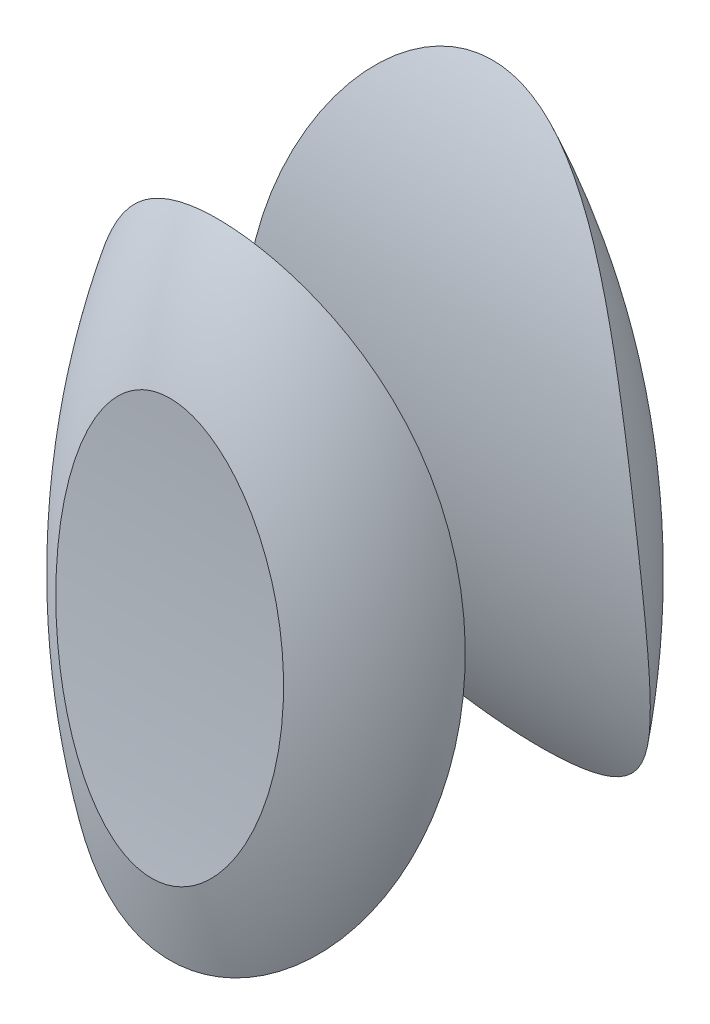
ISO-10303-21;
HEADER;
FILE_DESCRIPTION(('STEP AP214'),'2;1');
FILE_NAME('part.step','',(''),(''),'','','');
FILE_SCHEMA(('AUTOMOTIVE_DESIGN { 1 0 10303 214 1 1 1 1 }'));
ENDSEC;
DATA;
#1=APPLICATION_CONTEXT('core data for automotive mechanical design processes');
#2=APPLICATION_PROTOCOL_DEFINITION('international standard','automotive_design',2000,#1);
#3=PRODUCT_CONTEXT('',#1,'mechanical');
#4=PRODUCT('Part','Part','',(#3));
#5=PRODUCT_RELATED_PRODUCT_CATEGORY('part','',(#4));
#6=PRODUCT_DEFINITION_FORMATION('','',#4);
#7=PRODUCT_DEFINITION_CONTEXT('part definition',#1,'design');
#8=PRODUCT_DEFINITION('design','',#6,#7);
#9=PRODUCT_DEFINITION_SHAPE('','',#8);
#10=(LENGTH_UNIT() NAMED_UNIT(*) SI_UNIT(.MILLI.,.METRE.));
#11=(NAMED_UNIT(*) PLANE_ANGLE_UNIT() SI_UNIT($,.RADIAN.));
#12=(NAMED_UNIT(*) SI_UNIT($,.STERADIAN.) SOLID_ANGLE_UNIT());
#13=UNCERTAINTY_MEASURE_WITH_UNIT(LENGTH_MEASURE(1.E-05),#10,'distance_accuracy_value','');
#14=(GEOMETRIC_REPRESENTATION_CONTEXT(3) GLOBAL_UNCERTAINTY_ASSIGNED_CONTEXT((#13)) GLOBAL_UNIT_ASSIGNED_CONTEXT((#10,
#11,#12)) REPRESENTATION_CONTEXT('',''));
#15=CARTESIAN_POINT('',(0.,0.,0.));
#16=DIRECTION('',(0.,0.,1.));
#17=DIRECTION('',(1.,0.,0.));
#18=AXIS2_PLACEMENT_3D('',#15,#16,#17);
#19=CARTESIAN_POINT('',(-19.0366667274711,51.0993200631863,-67.4577213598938));
#20=DIRECTION('',(1.,0.,0.));
#21=DIRECTION('',(0.,0.,-1.));
#22=AXIS2_PLACEMENT_3D('',#19,#20,#21);
#23=CYLINDRICAL_SURFACE('',#22,60.);
#24=CARTESIAN_POINT('',(-11.6934335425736,25.8126324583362,-13.046477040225));
#25=CARTESIAN_POINT('',(-11.40823626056,25.4621805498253,-13.209343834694));
#26=CARTESIAN_POINT('',(-11.1099455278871,25.1220307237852,-13.3715493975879));
#27=CARTESIAN_POINT('',(-10.48652405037,24.4651300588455,-13.69199375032));
#28=CARTESIAN_POINT('',(-10.1613915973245,24.1483807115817,-13.8502322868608));
#29=CARTESIAN_POINT('',(-9.48428016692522,23.5416527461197,-14.159589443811));
#30=CARTESIAN_POINT('',(-9.13232069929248,23.2516550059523,-14.3107131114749));
#31=CARTESIAN_POINT('',(-8.4016611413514,22.7016438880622,-14.6025523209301));
#32=CARTESIAN_POINT('',(-8.0229674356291,22.4416233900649,-14.7432703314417));
#33=CARTESIAN_POINT('',(-7.31750731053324,22.0034181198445,-14.9841272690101));
#34=CARTESIAN_POINT('',(-6.99532243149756,21.8192273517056,-15.086781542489));
#35=CARTESIAN_POINT('',(-6.33542382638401,21.4744021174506,-15.2810657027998));
#36=CARTESIAN_POINT('',(-5.99771341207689,21.3137626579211,-15.3726979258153));
#37=CARTESIAN_POINT('',(-5.30826472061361,21.0179787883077,-15.5429638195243));
#38=CARTESIAN_POINT('',(-4.95653180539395,20.8828247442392,-15.6216024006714));
#39=CARTESIAN_POINT('',(-4.24082486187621,20.6397346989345,-15.7640705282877));
#40=CARTESIAN_POINT('',(-3.87685068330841,20.5317990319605,-15.8278998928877));
#41=CARTESIAN_POINT('',(-3.13673376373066,20.3441391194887,-15.9394637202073));
#42=CARTESIAN_POINT('',(-2.76052834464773,20.2645986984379,-15.9870932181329));
#43=CARTESIAN_POINT('',(-2.00109992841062,20.1359708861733,-16.0643690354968));
#44=CARTESIAN_POINT('',(-1.61787688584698,20.0868836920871,-16.0940152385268));
#45=CARTESIAN_POINT('',(-0.847827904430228,20.0200046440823,-16.1344547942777));
#46=CARTESIAN_POINT('',(-0.46100307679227,20.0022034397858,-16.1452537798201));
#47=CARTESIAN_POINT('',(0.312852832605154,19.9981817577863,-16.1476909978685));
#48=CARTESIAN_POINT('',(0.699883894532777,20.0119586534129,-16.139330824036));
#49=CARTESIAN_POINT('',(1.4310741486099,20.0678138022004,-16.105540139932));
#50=CARTESIAN_POINT('',(1.77555739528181,20.1068429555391,-16.081949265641));
#51=CARTESIAN_POINT('',(2.45945723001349,20.2095813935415,-16.0201121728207));
#52=CARTESIAN_POINT('',(2.79887423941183,20.2732886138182,-15.9818671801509));
#53=CARTESIAN_POINT('',(3.47045165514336,20.4245448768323,-15.8915900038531));
#54=CARTESIAN_POINT('',(3.80261224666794,20.5120933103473,-15.8395581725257));
#55=CARTESIAN_POINT('',(4.45779143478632,20.7099548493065,-15.7228234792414));
#56=CARTESIAN_POINT('',(4.78080956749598,20.820269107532,-15.658119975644));
#57=CARTESIAN_POINT('',(5.42525175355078,21.0658915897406,-15.5153117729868));
#58=CARTESIAN_POINT('',(5.74636213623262,21.2018279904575,-15.4368748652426));
#59=CARTESIAN_POINT('',(6.37584075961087,21.4949671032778,-15.2694970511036));
#60=CARTESIAN_POINT('',(6.68420915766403,21.6521695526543,-15.1805562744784));
#61=CARTESIAN_POINT('',(7.28730803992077,21.9863507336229,-14.9937180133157));
#62=CARTESIAN_POINT('',(7.58203449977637,22.1633352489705,-14.8958179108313));
#63=CARTESIAN_POINT('',(8.15712080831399,22.5355171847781,-14.692636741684));
#64=CARTESIAN_POINT('',(8.43747763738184,22.73071840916,-14.5873541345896));
#65=CARTESIAN_POINT('',(9.11420435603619,23.2353839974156,-14.3190617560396));
#66=CARTESIAN_POINT('',(9.50181756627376,23.5547924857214,-14.1525572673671));
#67=CARTESIAN_POINT('',(10.2443089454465,24.225629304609,-13.8112257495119));
#68=CARTESIAN_POINT('',(10.5991749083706,24.5770694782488,-13.6363956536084));
#69=CARTESIAN_POINT('',(11.2771108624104,25.3084384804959,-13.2821202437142));
#70=CARTESIAN_POINT('',(11.6001237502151,25.6884163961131,-13.1026673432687));
#71=CARTESIAN_POINT('',(12.2145446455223,26.4726063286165,-12.7429039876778));
#72=CARTESIAN_POINT('',(12.5059520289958,26.8768188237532,-12.5625935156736));
#73=CARTESIAN_POINT('',(13.1610613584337,27.8604122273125,-12.1374125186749));
#74=CARTESIAN_POINT('',(13.5114185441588,28.4490954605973,-11.8934354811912));
#75=CARTESIAN_POINT('',(14.1586310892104,29.6590231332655,-11.415439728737));
#76=CARTESIAN_POINT('',(14.4554677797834,30.2802788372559,-11.1814245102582));
#77=CARTESIAN_POINT('',(14.9994543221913,31.5499888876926,-10.7278479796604));
#78=CARTESIAN_POINT('',(15.2465532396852,32.1984703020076,-10.5083016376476));
#79=CARTESIAN_POINT('',(15.6940790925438,33.5169771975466,-10.0875161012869));
#80=CARTESIAN_POINT('',(15.8945057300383,34.1870028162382,-9.88627702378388));
#81=CARTESIAN_POINT('',(16.3060689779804,35.7505567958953,-9.44686541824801));
#82=CARTESIAN_POINT('',(16.5019821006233,36.6501804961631,-9.21602955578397));
#83=CARTESIAN_POINT('',(16.8256248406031,38.470858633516,-8.79430837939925));
#84=CARTESIAN_POINT('',(16.9533349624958,39.3919191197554,-8.60343449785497));
#85=CARTESIAN_POINT('',(17.1452067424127,41.2487126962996,-8.26433870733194));
#86=CARTESIAN_POINT('',(17.2093429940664,42.1844515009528,-8.116133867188));
#87=CARTESIAN_POINT('',(17.2774930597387,44.0639061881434,-7.86408072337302));
#88=CARTESIAN_POINT('',(17.281511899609,45.0076213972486,-7.76022871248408));
#89=CARTESIAN_POINT('',(17.2315524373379,46.9092385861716,-7.59650400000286));
#90=CARTESIAN_POINT('',(17.1768458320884,47.8671700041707,-7.53719944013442));
#91=CARTESIAN_POINT('',(17.0096685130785,49.7797734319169,-7.4645991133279));
#92=CARTESIAN_POINT('',(16.8971939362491,50.7344452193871,-7.45130642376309));
#93=CARTESIAN_POINT('',(16.6146541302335,52.6350855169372,-7.46984886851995));
#94=CARTESIAN_POINT('',(16.4445716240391,53.5810513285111,-7.50169755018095));
#95=CARTESIAN_POINT('',(16.0458264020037,55.4579544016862,-7.60886464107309));
#96=CARTESIAN_POINT('',(15.8171718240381,56.3888937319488,-7.68417701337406));
#97=CARTESIAN_POINT('',(15.3293880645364,58.1208741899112,-7.86440231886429));
#98=CARTESIAN_POINT('',(15.0770330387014,58.9242868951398,-7.9647768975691));
#99=CARTESIAN_POINT('',(14.6608346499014,60.1129977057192,-8.13728413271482));
#100=CARTESIAN_POINT('',(14.5157951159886,60.506568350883,-8.19845691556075));
#101=CARTESIAN_POINT('',(14.2126905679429,61.2874970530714,-8.32771556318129));
#102=CARTESIAN_POINT('',(14.0546266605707,61.6748556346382,-8.39580084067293));
#103=CARTESIAN_POINT('',(13.725206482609,62.4419457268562,-8.53831196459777));
#104=CARTESIAN_POINT('',(13.5538717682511,62.8216883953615,-8.61272754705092));
#105=CARTESIAN_POINT('',(13.1970817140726,63.5732535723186,-8.7674482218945));
#106=CARTESIAN_POINT('',(13.0116268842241,63.9450763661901,-8.84775310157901));
#107=CARTESIAN_POINT('',(12.6259986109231,64.6795538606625,-9.01356945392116));
#108=CARTESIAN_POINT('',(12.4258337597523,65.0422137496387,-9.0990778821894));
#109=CARTESIAN_POINT('',(12.0098670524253,65.757416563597,-9.27459824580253));
#110=CARTESIAN_POINT('',(11.7940630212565,66.1099580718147,-9.36461080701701));
#111=CARTESIAN_POINT('',(11.3115014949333,66.8567604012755,-9.56234813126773));
#112=CARTESIAN_POINT('',(11.0420101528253,67.2491068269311,-9.67066908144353));
#113=CARTESIAN_POINT('',(10.4796153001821,68.0156360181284,-9.89039421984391));
#114=CARTESIAN_POINT('',(10.1867182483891,68.3898237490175,-10.0017975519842));
#115=CARTESIAN_POINT('',(9.57602526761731,69.1166522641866,-10.2255606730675));
#116=CARTESIAN_POINT('',(9.25824564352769,69.4693068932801,-10.3379197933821));
#117=CARTESIAN_POINT('',(8.59604584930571,70.1492235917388,-10.561068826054));
#118=CARTESIAN_POINT('',(8.25163249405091,70.4764921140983,-10.6718591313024));
#119=CARTESIAN_POINT('',(7.62279169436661,71.0239744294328,-10.8620465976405));
#120=CARTESIAN_POINT('',(7.3443868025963,71.2507499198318,-10.9424752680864));
#121=CARTESIAN_POINT('',(6.77121792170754,71.6843734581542,-11.0989716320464));
#122=CARTESIAN_POINT('',(6.47645417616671,71.8912218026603,-11.1750393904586));
#123=CARTESIAN_POINT('',(5.8709310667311,72.2817272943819,-11.3208437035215));
#124=CARTESIAN_POINT('',(5.56019224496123,72.4654132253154,-11.3905880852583));
#125=CARTESIAN_POINT('',(4.92291806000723,72.8065158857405,-11.5217663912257));
#126=CARTESIAN_POINT('',(4.59638692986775,72.963939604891,-11.5832025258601));
#127=CARTESIAN_POINT('',(4.00127279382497,73.2180437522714,-11.6833861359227));
#128=CARTESIAN_POINT('',(3.73548947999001,73.3204926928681,-11.7241641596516));
#129=CARTESIAN_POINT('',(3.19607185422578,73.5054231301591,-11.7982524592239));
#130=CARTESIAN_POINT('',(2.92243941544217,73.5879093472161,-11.831564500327));
#131=CARTESIAN_POINT('',(2.36887100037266,73.7313322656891,-11.8897627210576));
#132=CARTESIAN_POINT('',(2.08893926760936,73.7922830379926,-11.9146544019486));
#133=CARTESIAN_POINT('',(1.52439186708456,73.8914321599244,-11.9552663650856));
#134=CARTESIAN_POINT('',(1.23977616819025,73.9296303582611,-11.9709865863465));
#135=CARTESIAN_POINT('',(0.666767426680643,73.9825177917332,-11.9927766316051));
#136=CARTESIAN_POINT('',(0.378363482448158,73.9971066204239,-11.9988052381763));
#137=CARTESIAN_POINT('',(-0.198691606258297,74.0021138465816,-12.000872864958));
#138=CARTESIAN_POINT('',(-0.487342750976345,73.9925322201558,-11.9969118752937));
#139=CARTESIAN_POINT('',(-1.06261191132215,73.9494228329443,-11.9791368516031));
#140=CARTESIAN_POINT('',(-1.34922935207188,73.9158885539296,-11.965320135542));
#141=CARTESIAN_POINT('',(-1.91815618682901,73.8256420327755,-11.9282998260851));
#142=CARTESIAN_POINT('',(-2.20046558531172,73.7689298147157,-11.9050962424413));
#143=CARTESIAN_POINT('',(-2.74333110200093,73.6373244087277,-11.8515787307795));
#144=CARTESIAN_POINT('',(-3.00422364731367,73.563618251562,-11.8217322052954));
#145=CARTESIAN_POINT('',(-3.51918423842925,73.3979225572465,-11.7551155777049));
#146=CARTESIAN_POINT('',(-3.77325273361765,73.3059342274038,-11.7183459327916));
#147=CARTESIAN_POINT('',(-4.27366035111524,73.1050754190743,-11.6387426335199));
#148=CARTESIAN_POINT('',(-4.5199984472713,72.9962027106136,-11.5959081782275));
#149=CARTESIAN_POINT('',(-5.00430119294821,72.7630300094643,-11.5050686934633));
#150=CARTESIAN_POINT('',(-5.24226377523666,72.6387262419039,-11.4570623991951));
#151=CARTESIAN_POINT('',(-5.84605095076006,72.2992955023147,-11.3274214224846));
#152=CARTESIAN_POINT('',(-6.20525718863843,72.0735698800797,-11.2425402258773));
#153=CARTESIAN_POINT('',(-6.90108127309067,71.5922044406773,-11.0652793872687));
#154=CARTESIAN_POINT('',(-7.23768780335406,71.3365498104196,-10.972896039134));
#155=CARTESIAN_POINT('',(-7.88935177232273,70.7993052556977,-10.7832834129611));
#156=CARTESIAN_POINT('',(-8.20435643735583,70.5176555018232,-10.6860432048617));
#157=CARTESIAN_POINT('',(-8.81279025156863,69.9327825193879,-10.489345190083));
#158=CARTESIAN_POINT('',(-9.10621995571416,69.6295598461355,-10.3898874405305));
#159=CARTESIAN_POINT('',(-9.61334532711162,69.0700706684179,-10.2115912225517));
#160=CARTESIAN_POINT('',(-9.83088119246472,68.817248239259,-10.1327911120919));
#161=CARTESIAN_POINT('',(-10.2537342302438,68.3013592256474,-9.97587532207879));
#162=CARTESIAN_POINT('',(-10.4590499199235,68.0382914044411,-9.89775972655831));
#163=CARTESIAN_POINT('',(-11.0576506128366,67.2352485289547,-9.6654915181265));
#164=CARTESIAN_POINT('',(-11.433482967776,66.6815530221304,-9.51345575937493));
#165=CARTESIAN_POINT('',(-12.1430377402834,65.5443859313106,-9.21953851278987));
#166=CARTESIAN_POINT('',(-12.4766980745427,64.9608721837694,-9.0776721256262));
#167=CARTESIAN_POINT('',(-13.1049133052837,63.770183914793,-8.80772785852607));
#168=CARTESIAN_POINT('',(-13.3994709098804,63.1630110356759,-8.67964902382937));
#169=CARTESIAN_POINT('',(-13.8748599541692,62.1022742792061,-8.47348786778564));
#170=CARTESIAN_POINT('',(-14.0644291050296,61.6533469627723,-8.39145312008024));
#171=CARTESIAN_POINT('',(-14.4257092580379,60.746746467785,-8.23662220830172));
#172=CARTESIAN_POINT('',(-14.5974188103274,60.2890725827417,-8.16382679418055));
#173=CARTESIAN_POINT('',(-14.9237349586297,59.3660929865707,-8.02811479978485));
#174=CARTESIAN_POINT('',(-15.0783367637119,58.9007851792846,-7.96520098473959));
#175=CARTESIAN_POINT('',(-15.3709963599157,57.9636727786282,-7.84980602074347));
#176=CARTESIAN_POINT('',(-15.509052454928,57.491867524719,-7.79732594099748));
#177=CARTESIAN_POINT('',(-15.7691148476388,56.5426356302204,-7.70324188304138));
#178=CARTESIAN_POINT('',(-15.891116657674,56.0652074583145,-7.66164094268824));
#179=CARTESIAN_POINT('',(-16.1193852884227,55.1057499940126,-7.58969888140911));
#180=CARTESIAN_POINT('',(-16.2256506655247,54.6237202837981,-7.55935879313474));
#181=CARTESIAN_POINT('',(-16.5211980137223,53.1722353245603,-7.48572200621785));
#182=CARTESIAN_POINT('',(-16.6873294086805,52.1970228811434,-7.45977259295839));
#183=CARTESIAN_POINT('',(-16.9607592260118,50.2231257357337,-7.4558735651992));
#184=CARTESIAN_POINT('',(-17.0671142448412,49.224310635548,-7.47866775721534));
#185=CARTESIAN_POINT('',(-17.216544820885,47.2242098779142,-7.57462028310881));
#186=CARTESIAN_POINT('',(-17.2596142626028,46.2229239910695,-7.64778348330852));
#187=CARTESIAN_POINT('',(-17.2805681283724,44.2247530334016,-7.84439991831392));
#188=CARTESIAN_POINT('',(-17.2584633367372,43.227867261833,-7.96784483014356));
#189=CARTESIAN_POINT('',(-17.145861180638,41.2454024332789,-8.26393750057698));
#190=CARTESIAN_POINT('',(-17.055379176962,40.2598208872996,-8.43657420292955));
#191=CARTESIAN_POINT('',(-16.8246174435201,38.4859072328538,-8.79287212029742));
#192=CARTESIAN_POINT('',(-16.6964488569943,37.6944216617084,-8.96876303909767));
#193=CARTESIAN_POINT('',(-16.3880590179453,36.1286570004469,-9.34982075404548));
#194=CARTESIAN_POINT('',(-16.2078353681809,35.3543787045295,-9.55498889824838));
#195=CARTESIAN_POINT('',(-15.7919398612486,33.8302947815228,-9.99114243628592));
#196=CARTESIAN_POINT('',(-15.5563961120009,33.080437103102,-10.2220675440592));
#197=CARTESIAN_POINT('',(-15.0251964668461,31.6098136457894,-10.7060042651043));
#198=CARTESIAN_POINT('',(-14.7295695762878,30.8890340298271,-10.959005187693));
#199=CARTESIAN_POINT('',(-14.2186135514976,29.795159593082,-11.3657634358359));
#200=CARTESIAN_POINT('',(-14.0256655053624,29.4093910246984,-11.5138781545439));
#201=CARTESIAN_POINT('',(-13.6186730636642,28.6507306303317,-11.8139703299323));
#202=CARTESIAN_POINT('',(-13.4046324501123,28.2778365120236,-11.9659470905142));
#203=CARTESIAN_POINT('',(-12.9544763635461,27.5464590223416,-12.2723969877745));
#204=CARTESIAN_POINT('',(-12.7183534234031,27.1879805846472,-12.4268709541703));
#205=CARTESIAN_POINT('',(-12.2232341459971,26.4874487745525,-12.7365876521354));
#206=CARTESIAN_POINT('',(-11.9642363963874,26.1453964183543,-12.8918304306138));
#207=CARTESIAN_POINT('',(-11.6934335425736,25.8126324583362,-13.046477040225));
#208=B_SPLINE_CURVE_WITH_KNOTS('',3,(#24,#25,#26,#27,#28,#29,#30,#31,#32,#33,#34,#35,#36,#37,
#38,#39,#40,#41,#42,#43,#44,#45,#46,#47,#48,#49,#50,#51,#52,#53,#54,#55,#56,#57,#58,#59,#60,#61,
#62,#63,#64,#65,#66,#67,#68,#69,#70,#71,#72,#73,#74,#75,#76,#77,#78,#79,#80,#81,#82,#83,#84,#85,
#86,#87,#88,#89,#90,#91,#92,#93,#94,#95,#96,#97,#98,#99,#100,#101,#102,#103,#104,#105,#106,#107,
#108,#109,#110,#111,#112,#113,#114,#115,#116,#117,#118,#119,#120,#121,#122,#123,#124,#125,#126,
#127,#128,#129,#130,#131,#132,#133,#134,#135,#136,#137,#138,#139,#140,#141,#142,#143,#144,#145,
#146,#147,#148,#149,#150,#151,#152,#153,#154,#155,#156,#157,#158,#159,#160,#161,#162,#163,#164,
#165,#166,#167,#168,#169,#170,#171,#172,#173,#174,#175,#176,#177,#178,#179,#180,#181,#182,#183,
#184,#185,#186,#187,#188,#189,#190,#191,#192,#193,#194,#195,#196,#197,#198,#199,#200,#201,#202,
#203,#204,#205,#206,#207),.UNSPECIFIED.,.T.,.F.,(4,2,2,2,2,2,2,2,2,2,2,2,2,2,2,2,2,2,2,2,2,2,2,
2,2,2,2,2,2,2,2,2,2,2,2,2,2,2,2,2,2,2,2,2,2,2,2,2,2,2,2,2,2,2,2,2,2,2,2,2,2,2,2,2,2,2,2,2,2,2,2,
2,2,2,2,2,2,2,2,2,2,2,2,2,2,2,2,2,2,2,2,4),(0.,1.44059524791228,2.88128224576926,
4.32093133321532,5.76023776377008,6.91431452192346,8.06814623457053,9.22154089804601,
10.374949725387,11.5356955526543,12.6964488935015,13.8568552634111,15.0171651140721,
16.05841396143,17.0995757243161,18.1407108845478,19.181898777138,20.2530644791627,
21.3242169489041,22.3956834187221,23.4673741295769,25.0524158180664,26.638045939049,
28.2264688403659,29.8149230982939,31.9933162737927,34.172467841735,36.3538397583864,
38.5352255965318,41.3789021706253,44.2233911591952,47.0690164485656,49.9144038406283,
52.7954913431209,55.6767715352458,58.5589166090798,61.4406614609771,63.9825527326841,
65.2539498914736,66.5252391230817,67.7945049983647,69.0637250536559,70.3322095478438,
71.6008707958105,73.0644933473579,74.5277134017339,75.9899825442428,77.4518787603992,
78.5549971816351,79.6580991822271,80.7598165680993,81.8612402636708,82.7236759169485,
83.5859074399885,84.4475745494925,85.3092473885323,86.1745752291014,87.0399039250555,
87.9054681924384,88.7710315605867,89.5884395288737,90.4057935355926,91.223255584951,
92.0409180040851,93.3368091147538,94.6333443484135,95.9329418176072,97.2325058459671,
98.260251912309,99.2881224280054,101.344353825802,103.403577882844,105.462659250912,
106.944704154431,108.42686927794,109.909448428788,111.392179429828,112.87532402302,
114.358604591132,117.324040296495,120.335049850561,123.346350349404,126.357152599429,
129.367278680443,131.827713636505,134.288261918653,136.743167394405,139.196890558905,
140.564472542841,141.931809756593,143.299611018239,144.667496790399),.UNSPECIFIED.);
#209=CARTESIAN_POINT('',(-11.6934335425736,25.8126324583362,-13.046477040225));
#210=VERTEX_POINT('',#209);
#211=EDGE_CURVE('E43',#210,#210,#208,.T.);
#212=ORIENTED_EDGE('',*,*,#211,.T.);
#213=EDGE_LOOP('',(#212));
#214=FACE_BOUND('',#213,.T.);
#215=ADVANCED_FACE('F38',(#214),#23,.T.);
#216=CARTESIAN_POINT('',(0.,41.25,0.));
#217=DIRECTION('',(0.,1.,0.));
#218=DIRECTION('',(0.,0.,1.));
#219=AXIS2_PLACEMENT_3D('',#216,#217,#218);
#220=DEGENERATE_TOROIDAL_SURFACE('',#219,60.8075269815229,79.834193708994,.F.);
#221=CARTESIAN_POINT('',(-7.72043957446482,33.5090740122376,-16.9775024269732));
#222=CARTESIAN_POINT('',(-7.47341911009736,32.970534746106,-17.0322042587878));
#223=CARTESIAN_POINT('',(-7.20158457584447,32.4432461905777,-17.0879841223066));
#224=CARTESIAN_POINT('',(-6.75160292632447,31.6765659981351,-17.1719991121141));
#225=CARTESIAN_POINT('',(-6.5943805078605,31.4247926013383,-17.2000917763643));
#226=CARTESIAN_POINT('',(-6.26490240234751,30.93129914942,-17.2560688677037));
#227=CARTESIAN_POINT('',(-6.09265069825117,30.689576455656,-17.2839533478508));
#228=CARTESIAN_POINT('',(-5.72980185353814,30.215421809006,-17.3394878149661));
#229=CARTESIAN_POINT('',(-5.53900700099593,29.983138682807,-17.3671308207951));
#230=CARTESIAN_POINT('',(-5.13991651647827,29.53408335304,-17.4213179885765));
#231=CARTESIAN_POINT('',(-4.93161678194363,29.3173148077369,-17.4478618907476));
#232=CARTESIAN_POINT('',(-4.27998718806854,28.6969564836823,-17.5247874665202));
#233=CARTESIAN_POINT('',(-3.80820482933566,28.3209679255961,-17.5727410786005));
#234=CARTESIAN_POINT('',(-3.00166198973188,27.8188960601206,-17.6378285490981));
#235=CARTESIAN_POINT('',(-2.69152999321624,27.6539155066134,-17.659485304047));
#236=CARTESIAN_POINT('',(-2.20966296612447,27.4443886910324,-17.6871780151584));
#237=CARTESIAN_POINT('',(-2.04625264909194,27.3808678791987,-17.6956105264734));
#238=CARTESIAN_POINT('',(-1.71464217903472,27.2677184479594,-17.7106750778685));
#239=CARTESIAN_POINT('',(-1.54644399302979,27.2180842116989,-17.7173078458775));
#240=CARTESIAN_POINT('',(-1.2047572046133,27.133453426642,-17.7286400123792));
#241=CARTESIAN_POINT('',(-1.03123519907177,27.0985886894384,-17.7333219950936));
#242=CARTESIAN_POINT('',(-0.681738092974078,27.0450335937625,-17.7405217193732));
#243=CARTESIAN_POINT('',(-0.50576417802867,27.0263356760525,-17.7430404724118));
#244=CARTESIAN_POINT('',(-0.152816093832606,27.0056099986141,-17.7458326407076));
#245=CARTESIAN_POINT('',(0.0241580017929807,27.0035810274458,-17.7461062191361));
#246=CARTESIAN_POINT('',(0.377443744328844,27.0162178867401,-17.7444035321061));
#247=CARTESIAN_POINT('',(0.553755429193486,27.0308827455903,-17.7424273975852));
#248=CARTESIAN_POINT('',(1.04313162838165,27.0947062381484,-17.7338403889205));
#249=CARTESIAN_POINT('',(1.35395023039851,27.1619820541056,-17.7247987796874));
#250=CARTESIAN_POINT('',(1.96090495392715,27.3437137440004,-17.7005374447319));
#251=CARTESIAN_POINT('',(2.25703347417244,27.4581937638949,-17.6853145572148));
#252=CARTESIAN_POINT('',(2.94419814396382,27.780287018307,-17.6428756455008));
#253=CARTESIAN_POINT('',(3.32619381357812,28.0068317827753,-17.6132976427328));
#254=CARTESIAN_POINT('',(4.04900634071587,28.517465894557,-17.547768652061));
#255=CARTESIAN_POINT('',(4.38972491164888,28.8016884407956,-17.5118029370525));
#256=CARTESIAN_POINT('',(4.95900221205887,29.3431863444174,-17.4446518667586));
#257=CARTESIAN_POINT('',(5.19560354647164,29.5922732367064,-17.4141962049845));
#258=CARTESIAN_POINT('',(5.64616346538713,30.1101405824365,-17.3519488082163));
#259=CARTESIAN_POINT('',(5.86010924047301,30.378932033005,-17.3201563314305));
#260=CARTESIAN_POINT('',(6.26713120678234,30.9322870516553,-17.2559149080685));
#261=CARTESIAN_POINT('',(6.46017707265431,31.2168726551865,-17.2234650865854));
#262=CARTESIAN_POINT('',(6.82669738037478,31.7984169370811,-17.1584768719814));
#263=CARTESIAN_POINT('',(7.00016499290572,32.0953798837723,-17.1259384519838));
#264=CARTESIAN_POINT('',(7.44107468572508,32.9051526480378,-17.0391160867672));
#265=CARTESIAN_POINT('',(7.69193525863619,33.427061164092,-16.9851342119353));
#266=CARTESIAN_POINT('',(8.14797277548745,34.4907555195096,-16.8795185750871));
#267=CARTESIAN_POINT('',(8.35311994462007,35.0325540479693,-16.8278863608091));
#268=CARTESIAN_POINT('',(8.72216692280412,36.1311833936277,-16.7278402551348));
#269=CARTESIAN_POINT('',(8.88600116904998,36.6880365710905,-16.679431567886));
#270=CARTESIAN_POINT('',(9.17516695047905,37.8117796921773,-16.5865778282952));
#271=CARTESIAN_POINT('',(9.30050313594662,38.3786684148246,-16.5421322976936));
#272=CARTESIAN_POINT('',(9.56178984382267,39.7677503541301,-16.4392698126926));
#273=CARTESIAN_POINT('',(9.67864724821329,40.593746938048,-16.3831838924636));
#274=CARTESIAN_POINT('',(9.84266954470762,42.2534432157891,-16.2809501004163));
#275=CARTESIAN_POINT('',(9.88980068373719,43.0871464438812,-16.2348070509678));
#276=CARTESIAN_POINT('',(9.91655160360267,44.75670301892,-16.1529196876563));
#277=CARTESIAN_POINT('',(9.89612423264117,45.5925574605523,-16.1171826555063));
#278=CARTESIAN_POINT('',(9.78797037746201,47.2600402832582,-16.0563398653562));
#279=CARTESIAN_POINT('',(9.70027046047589,48.0916702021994,-16.0312299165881));
#280=CARTESIAN_POINT('',(9.48438798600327,49.5519067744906,-15.9961637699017));
#281=CARTESIAN_POINT('',(9.37043360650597,50.1825909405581,-15.9840384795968));
#282=CARTESIAN_POINT('',(9.1001610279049,51.4351121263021,-15.9658104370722));
#283=CARTESIAN_POINT('',(8.943836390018,52.0569477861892,-15.9597086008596));
#284=CARTESIAN_POINT('',(8.58658991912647,53.2857463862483,-15.9532748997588));
#285=CARTESIAN_POINT('',(8.38580317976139,53.8927483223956,-15.9529257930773));
#286=CARTESIAN_POINT('',(7.93528994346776,55.0881832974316,-15.9575394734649));
#287=CARTESIAN_POINT('',(7.68559684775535,55.67662869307,-15.9624986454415));
#288=CARTESIAN_POINT('',(7.27199811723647,56.5347898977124,-15.9733626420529));
#289=CARTESIAN_POINT('',(7.12890177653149,56.8146426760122,-15.9775089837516));
#290=CARTESIAN_POINT('',(6.82840753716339,57.3665165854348,-15.9868135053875));
#291=CARTESIAN_POINT('',(6.67101292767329,57.6385394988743,-15.9919714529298));
#292=CARTESIAN_POINT('',(6.3407270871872,58.1731984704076,-16.0031654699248));
#293=CARTESIAN_POINT('',(6.16782876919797,58.4358301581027,-16.0092019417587));
#294=CARTESIAN_POINT('',(5.80531986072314,58.9493044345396,-16.0219743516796));
#295=CARTESIAN_POINT('',(5.6157120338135,59.2001489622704,-16.0287101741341));
#296=CARTESIAN_POINT('',(5.25641414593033,59.6404211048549,-16.0413162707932));
#297=CARTESIAN_POINT('',(5.08986510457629,59.832409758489,-16.0471052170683));
#298=CARTESIAN_POINT('',(4.74409014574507,60.2047105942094,-16.0588371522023));
#299=CARTESIAN_POINT('',(4.56486294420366,60.3850215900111,-16.0647801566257));
#300=CARTESIAN_POINT('',(4.1933689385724,60.7310160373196,-16.0766181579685));
#301=CARTESIAN_POINT('',(4.00112916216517,60.8967282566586,-16.082513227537));
#302=CARTESIAN_POINT('',(3.60288008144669,61.2106510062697,-16.094032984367));
#303=CARTESIAN_POINT('',(3.39687275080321,61.3588640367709,-16.0996577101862));
#304=CARTESIAN_POINT('',(2.90157693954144,61.6786243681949,-16.1121014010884));
#305=CARTESIAN_POINT('',(2.60693215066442,61.8421717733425,-16.1187167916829));
#306=CARTESIAN_POINT('',(2.14864838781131,62.0511823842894,-16.1273582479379));
#307=CARTESIAN_POINT('',(1.99316250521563,62.1148022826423,-16.1300251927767));
#308=CARTESIAN_POINT('',(1.67736585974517,62.2286245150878,-16.1348398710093));
#309=CARTESIAN_POINT('',(1.51705727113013,62.2788327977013,-16.136987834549));
#310=CARTESIAN_POINT('',(1.19085204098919,62.3650365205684,-16.140698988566));
#311=CARTESIAN_POINT('',(1.02491463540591,62.4008788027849,-16.1422558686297));
#312=CARTESIAN_POINT('',(0.690438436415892,62.456560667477,-16.1446829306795));
#313=CARTESIAN_POINT('',(0.521900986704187,62.4764082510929,-16.1455534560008));
#314=CARTESIAN_POINT('',(0.183710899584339,62.4995013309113,-16.1465668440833));
#315=CARTESIAN_POINT('',(0.0140585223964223,62.5027505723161,-16.1467098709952));
#316=CARTESIAN_POINT('',(-0.324690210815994,62.4925816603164,-16.146263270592));
#317=CARTESIAN_POINT('',(-0.493786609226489,62.4791648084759,-16.1456737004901));
#318=CARTESIAN_POINT('',(-0.954795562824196,62.4199594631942,-16.1430837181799));
#319=CARTESIAN_POINT('',(-1.24470320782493,62.3575345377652,-16.1403609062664));
#320=CARTESIAN_POINT('',(-1.81101077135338,62.188472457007,-16.1331246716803));
#321=CARTESIAN_POINT('',(-2.08740288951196,62.081810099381,-16.1286102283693));
#322=CARTESIAN_POINT('',(-2.73866169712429,61.7775072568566,-16.1160674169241));
#323=CARTESIAN_POINT('',(-3.10442151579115,61.5604705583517,-16.1073637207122));
#324=CARTESIAN_POINT('',(-3.79720300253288,61.0715061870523,-16.0887780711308));
#325=CARTESIAN_POINT('',(-4.12412424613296,60.7994409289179,-16.0788931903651));
#326=CARTESIAN_POINT('',(-4.68204093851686,60.2720294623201,-16.0609791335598));
#327=CARTESIAN_POINT('',(-4.91945722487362,60.0233379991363,-16.0529544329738));
#328=CARTESIAN_POINT('',(-5.37194606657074,59.506229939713,-16.037316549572));
#329=CARTESIAN_POINT('',(-5.58700428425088,59.2378008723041,-16.029703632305));
#330=CARTESIAN_POINT('',(-5.99683103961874,58.6853477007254,-16.0152173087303));
#331=CARTESIAN_POINT('',(-6.19156815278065,58.4013004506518,-16.0083450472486));
#332=CARTESIAN_POINT('',(-6.56221653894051,57.8210785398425,-15.9956004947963));
#333=CARTESIAN_POINT('',(-6.73812108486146,57.5248995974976,-15.9897285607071));
#334=CARTESIAN_POINT('',(-7.05217821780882,56.9595543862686,-15.9798204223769));
#335=CARTESIAN_POINT('',(-7.19231980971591,56.6914882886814,-15.9756477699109));
#336=CARTESIAN_POINT('',(-7.46006520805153,56.1491340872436,-15.9683222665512));
#337=CARTESIAN_POINT('',(-7.58766715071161,55.8748450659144,-15.9651695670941));
#338=CARTESIAN_POINT('',(-7.952905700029,55.0439309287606,-15.9573662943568));
#339=CARTESIAN_POINT('',(-8.17286824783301,54.4794545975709,-15.954374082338));
#340=CARTESIAN_POINT('',(-8.57045058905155,53.3349361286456,-15.9532944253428));
#341=CARTESIAN_POINT('',(-8.74799799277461,52.754869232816,-15.9552153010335));
#342=CARTESIAN_POINT('',(-9.06343237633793,51.5842717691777,-15.9642858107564));
#343=CARTESIAN_POINT('',(-9.20132553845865,50.9937428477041,-15.9714346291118));
#344=CARTESIAN_POINT('',(-9.48727739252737,49.5678429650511,-15.9951097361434));
#345=CARTESIAN_POINT('',(-9.6173989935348,48.7288844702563,-16.0142410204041));
#346=CARTESIAN_POINT('',(-9.80762439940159,47.0431312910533,-16.0634258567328));
#347=CARTESIAN_POINT('',(-9.8676950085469,46.1963330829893,-16.0934845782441));
#348=CARTESIAN_POINT('',(-9.91860138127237,44.5010453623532,-16.1644997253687));
#349=CARTESIAN_POINT('',(-9.90943143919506,43.6525557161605,-16.2054570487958));
#350=CARTESIAN_POINT('',(-9.82065984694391,41.9600990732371,-16.2979477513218));
#351=CARTESIAN_POINT('',(-9.74109170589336,41.1161301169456,-16.3494760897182));
#352=CARTESIAN_POINT('',(-9.54350868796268,39.6936744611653,-16.4452901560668));
#353=CARTESIAN_POINT('',(-9.44448447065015,39.1123335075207,-16.4870295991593));
#354=CARTESIAN_POINT('',(-9.20867597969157,37.9575600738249,-16.5749570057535));
#355=CARTESIAN_POINT('',(-9.07188868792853,37.3841282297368,-16.621145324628));
#356=CARTESIAN_POINT('',(-8.75840751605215,36.2505166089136,-16.7172966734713));
#357=CARTESIAN_POINT('',(-8.5818446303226,35.6902998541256,-16.7672469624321));
#358=CARTESIAN_POINT('',(-8.18508655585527,34.5860792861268,-16.8702815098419));
#359=CARTESIAN_POINT('',(-7.96491584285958,34.0420665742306,-16.9233639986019));
#360=CARTESIAN_POINT('',(-7.72043957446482,33.5090740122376,-16.9775024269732));
#361=B_SPLINE_CURVE_WITH_KNOTS('',3,(#221,#222,#223,#224,#225,#226,#227,#228,#229,#230,#231,
#232,#233,#234,#235,#236,#237,#238,#239,#240,#241,#242,#243,#244,#245,#246,#247,#248,#249,#250,
#251,#252,#253,#254,#255,#256,#257,#258,#259,#260,#261,#262,#263,#264,#265,#266,#267,#268,#269,
#270,#271,#272,#273,#274,#275,#276,#277,#278,#279,#280,#281,#282,#283,#284,#285,#286,#287,#288,
#289,#290,#291,#292,#293,#294,#295,#296,#297,#298,#299,#300,#301,#302,#303,#304,#305,#306,#307,
#308,#309,#310,#311,#312,#313,#314,#315,#316,#317,#318,#319,#320,#321,#322,#323,#324,#325,#326,
#327,#328,#329,#330,#331,#332,#333,#334,#335,#336,#337,#338,#339,#340,#341,#342,#343,#344,#345,
#346,#347,#348,#349,#350,#351,#352,#353,#354,#355,#356,#357,#358,#359,#360),.UNSPECIFIED.,.T.,
.F.,(4,2,2,2,2,2,2,2,2,2,2,2,2,2,2,2,2,2,2,2,2,2,2,2,2,2,2,2,2,2,2,2,2,2,2,2,2,2,2,2,2,2,2,2,2,
2,2,2,2,2,2,2,2,2,2,2,2,2,2,2,2,2,2,2,2,2,2,2,2,4),(0.,1.78422981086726,2.6782530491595,
3.57204007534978,4.4767019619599,5.38157646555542,7.182647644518,8.23458024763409,
8.7606065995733,9.28641987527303,9.81683170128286,10.3469953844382,10.8771205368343,
11.4072148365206,12.3569956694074,13.3072629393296,14.6350997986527,15.9660387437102,
16.999331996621,18.0332063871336,19.0685613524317,20.1042763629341,21.8462629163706,
23.5893807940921,25.3352477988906,27.0809038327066,29.5858069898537,32.0919223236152,
34.5997871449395,37.1066620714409,39.028369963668,40.9503700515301,42.8666085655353,
44.7815428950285,45.7242322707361,46.6667053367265,47.6096114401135,48.5523618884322,
49.3145411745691,50.0767977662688,50.8375170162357,51.5981274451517,52.6051901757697,
53.1087535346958,53.6120931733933,54.1206647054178,54.6289816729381,55.137183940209,
55.6453465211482,56.5307088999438,57.4165763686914,58.6855578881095,59.9577522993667,
60.9880858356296,62.0190760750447,63.0516377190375,64.0845669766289,64.9917672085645,
65.8991020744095,67.714438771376,69.5328519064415,71.3509813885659,73.895279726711,
76.440783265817,78.986496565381,81.5309987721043,83.3034535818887,85.076050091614,
86.8428920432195,88.60874511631),.UNSPECIFIED.);
#362=CARTESIAN_POINT('',(-7.72043957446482,33.5090740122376,-16.9775024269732));
#363=VERTEX_POINT('',#362);
#364=EDGE_CURVE('E11',#363,#363,#361,.T.);
#365=ORIENTED_EDGE('',*,*,#364,.T.);
#366=EDGE_LOOP('',(#365));
#367=FACE_BOUND('',#366,.T.);
#368=ORIENTED_EDGE('',*,*,#211,.F.);
#369=EDGE_LOOP('',(#368));
#370=FACE_BOUND('',#369,.T.);
#371=ADVANCED_FACE('F40',(#367,#370),#220,.F.);
#372=CARTESIAN_POINT('',(-19.0266667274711,53.7193366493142,-215.953746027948));
#373=DIRECTION('',(1.,0.,0.));
#374=DIRECTION('',(0.,0.,-1.));
#375=AXIS2_PLACEMENT_3D('',#372,#373,#374);
#376=CYLINDRICAL_SURFACE('',#375,200.);
#377=ORIENTED_EDGE('',*,*,#364,.F.);
#378=EDGE_LOOP('',(#377));
#379=FACE_BOUND('',#378,.T.);
#380=ADVANCED_FACE('F57',(#379),#376,.F.);
#381=CLOSED_SHELL('',(#215,#371,#380));
#382=MANIFOLD_SOLID_BREP('B2',#381);
#383=CARTESIAN_POINT('',(-19.0366667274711,51.0993200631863,67.4577213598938));
#384=DIRECTION('',(1.,0.,0.));
#385=DIRECTION('',(0.,0.,-1.));
#386=AXIS2_PLACEMENT_3D('',#383,#384,#385);
#387=CYLINDRICAL_SURFACE('',#386,60.);
#388=CARTESIAN_POINT('',(-11.6934335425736,25.8126324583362,13.046477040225));
#389=CARTESIAN_POINT('',(-12.062273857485,26.2658681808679,12.8358440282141));
#390=CARTESIAN_POINT('',(-12.409221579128,26.7363365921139,12.6241140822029));
#391=CARTESIAN_POINT('',(-13.0613865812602,27.7066454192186,12.2031952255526));
#392=CARTESIAN_POINT('',(-13.3665832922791,28.2065001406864,11.9940076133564));
#393=CARTESIAN_POINT('',(-13.9380299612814,29.2322015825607,11.5816492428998));
#394=CARTESIAN_POINT('',(-14.2041761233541,29.7581127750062,11.3784956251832));
#395=CARTESIAN_POINT('',(-14.6988394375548,30.8307604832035,10.9819503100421));
#396=CARTESIAN_POINT('',(-14.9273571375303,31.3774966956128,10.7885584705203));
#397=CARTESIAN_POINT('',(-15.4362778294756,32.71841938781,10.3365475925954));
#398=CARTESIAN_POINT('',(-15.6990379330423,33.5214070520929,10.0840409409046));
#399=CARTESIAN_POINT('',(-16.1595922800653,35.1544812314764,9.60889916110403));
#400=CARTESIAN_POINT('',(-16.3573617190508,35.9845779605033,9.38627545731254));
#401=CARTESIAN_POINT('',(-16.6927608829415,37.6650736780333,8.97465102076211));
#402=CARTESIAN_POINT('',(-16.8303808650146,38.5154759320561,8.78565573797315));
#403=CARTESIAN_POINT('',(-17.049436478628,40.230494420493,8.44388179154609));
#404=CARTESIAN_POINT('',(-17.1308776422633,41.0951092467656,8.29109956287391));
#405=CARTESIAN_POINT('',(-17.2417676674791,42.8493253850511,8.02086833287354));
#406=CARTESIAN_POINT('',(-17.270240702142,43.7390947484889,7.90411493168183));
#407=CARTESIAN_POINT('',(-17.2746929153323,45.5230927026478,7.71066478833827));
#408=CARTESIAN_POINT('',(-17.2506707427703,46.4173214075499,7.6339690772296));
#409=CARTESIAN_POINT('',(-17.1516729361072,48.2062708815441,7.52080125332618));
#410=CARTESIAN_POINT('',(-17.0766515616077,49.1009913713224,7.48436532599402));
#411=CARTESIAN_POINT('',(-16.8763097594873,50.8856237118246,7.45146685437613));
#412=CARTESIAN_POINT('',(-16.7509876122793,51.7755353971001,7.45500567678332));
#413=CARTESIAN_POINT('',(-16.5132291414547,53.1731610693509,7.49137668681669));
#414=CARTESIAN_POINT('',(-16.4175536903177,53.6841561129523,7.5112583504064));
#415=CARTESIAN_POINT('',(-16.2090623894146,54.7019637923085,7.56381098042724));
#416=CARTESIAN_POINT('',(-16.0962478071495,55.208776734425,7.59648100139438));
#417=CARTESIAN_POINT('',(-15.8531271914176,56.2174354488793,7.67427143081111));
#418=CARTESIAN_POINT('',(-15.7228142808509,56.7192791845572,7.71939674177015));
#419=CARTESIAN_POINT('',(-15.4442963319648,57.7167393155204,7.82164934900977));
#420=CARTESIAN_POINT('',(-15.2960916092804,58.2123558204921,7.87877643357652));
#421=CARTESIAN_POINT('',(-14.981455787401,59.1954625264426,8.00439797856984));
#422=CARTESIAN_POINT('',(-14.815053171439,59.6829640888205,8.07287475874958));
#423=CARTESIAN_POINT('',(-14.4630988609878,60.6493850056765,8.22061131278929));
#424=CARTESIAN_POINT('',(-14.2775462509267,61.1283039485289,8.29987160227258));
#425=CARTESIAN_POINT('',(-13.8865268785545,62.075802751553,8.46833088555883));
#426=CARTESIAN_POINT('',(-13.6810732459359,62.5443891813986,8.55752333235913));
#427=CARTESIAN_POINT('',(-13.2491000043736,63.4698316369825,8.74491791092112));
#428=CARTESIAN_POINT('',(-13.0225838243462,63.9266895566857,8.8431185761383));
#429=CARTESIAN_POINT('',(-12.5327474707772,64.8541362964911,9.05357275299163));
#430=CARTESIAN_POINT('',(-12.2680285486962,65.323878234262,9.16631730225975));
#431=CARTESIAN_POINT('',(-11.7116185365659,66.2453022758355,9.39891545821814));
#432=CARTESIAN_POINT('',(-11.4199293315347,66.6969856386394,9.5187685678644));
#433=CARTESIAN_POINT('',(-10.8077719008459,67.5784858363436,9.76330141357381));
#434=CARTESIAN_POINT('',(-10.4873301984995,68.0083222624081,9.88797664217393));
#435=CARTESIAN_POINT('',(-9.81519566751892,68.8421906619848,10.1394871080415));
#436=CARTESIAN_POINT('',(-9.46351057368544,69.2462289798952,10.2663218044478));
#437=CARTESIAN_POINT('',(-8.82014257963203,69.9243409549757,10.4865743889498));
#438=CARTESIAN_POINT('',(-8.53589213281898,70.2053690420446,10.580301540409));
#439=CARTESIAN_POINT('',(-7.94777434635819,70.7471510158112,10.7651768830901));
#440=CARTESIAN_POINT('',(-7.64390673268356,71.007904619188,10.8563250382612));
#441=CARTESIAN_POINT('',(-7.01633685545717,71.5053692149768,11.033765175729));
#442=CARTESIAN_POINT('',(-6.69266063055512,71.7421107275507,11.1200632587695));
#443=CARTESIAN_POINT('',(-6.02497395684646,72.1878621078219,11.2853982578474));
#444=CARTESIAN_POINT('',(-5.68097043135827,72.3968813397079,11.3644376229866));
#445=CARTESIAN_POINT('',(-5.06618502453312,72.7319684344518,11.492984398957));
#446=CARTESIAN_POINT('',(-4.79989281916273,72.8654067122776,11.5447969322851));
#447=CARTESIAN_POINT('',(-4.25723260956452,73.1127474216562,11.6417142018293));
#448=CARTESIAN_POINT('',(-3.98086737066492,73.2266551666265,11.6868207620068));
#449=CARTESIAN_POINT('',(-3.41924030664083,73.432911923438,11.7690957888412));
#450=CARTESIAN_POINT('',(-3.13398481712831,73.5252759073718,11.8062697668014));
#451=CARTESIAN_POINT('',(-2.55589911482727,73.6866893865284,11.8715868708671));
#452=CARTESIAN_POINT('',(-2.26306886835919,73.7557387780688,11.8997299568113));
#453=CARTESIAN_POINT('',(-1.66956948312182,73.8693844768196,11.9462091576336));
#454=CARTESIAN_POINT('',(-1.36885757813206,73.9137901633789,11.9644687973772));
#455=CARTESIAN_POINT('',(-0.764231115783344,73.976214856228,11.990173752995));
#456=CARTESIAN_POINT('',(-0.460316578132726,73.9942340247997,11.9976191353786));
#457=CARTESIAN_POINT('',(0.147946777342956,74.0034097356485,12.0014079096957));
#458=CARTESIAN_POINT('',(0.452295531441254,73.9945698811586,11.9977527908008));
#459=CARTESIAN_POINT('',(1.05869793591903,73.9502682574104,11.9794847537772));
#460=CARTESIAN_POINT('',(1.36075169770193,73.914807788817,11.9648723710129));
#461=CARTESIAN_POINT('',(1.92803208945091,73.8233419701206,11.9273606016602));
#462=CARTESIAN_POINT('',(2.19375282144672,73.7699289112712,11.9055103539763));
#463=CARTESIAN_POINT('',(2.71971903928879,73.6436244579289,11.8541335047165));
#464=CARTESIAN_POINT('',(2.97996511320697,73.5707351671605,11.8246077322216));
#465=CARTESIAN_POINT('',(3.49378581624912,73.4067200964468,11.7586396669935));
#466=CARTESIAN_POINT('',(3.74735892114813,73.3155901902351,11.7221958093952));
#467=CARTESIAN_POINT('',(4.24685957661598,73.1164969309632,11.6432484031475));
#468=CARTESIAN_POINT('',(4.49278528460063,73.0085295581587,11.6007434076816));
#469=CARTESIAN_POINT('',(5.08815287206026,72.723689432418,11.4896986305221));
#470=CARTESIAN_POINT('',(5.43286957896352,72.5380419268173,11.4182094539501));
#471=CARTESIAN_POINT('',(6.10339589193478,72.13820921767,11.2668783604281));
#472=CARTESIAN_POINT('',(6.42919775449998,71.9240124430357,11.1870330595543));
#473=CARTESIAN_POINT('',(7.06226099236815,71.4706496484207,11.0213212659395));
#474=CARTESIAN_POINT('',(7.36948383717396,71.231434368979,10.9354430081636));
#475=CARTESIAN_POINT('',(7.96500648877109,70.7318974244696,10.759995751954));
#476=CARTESIAN_POINT('',(8.25330619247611,70.4715756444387,10.6704267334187));
#477=CARTESIAN_POINT('',(8.96742716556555,69.782503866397,10.4390044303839));
#478=CARTESIAN_POINT('',(9.38032078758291,69.3407585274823,10.2958388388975));
#479=CARTESIAN_POINT('',(10.1652957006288,68.4219924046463,10.0107297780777));
#480=CARTESIAN_POINT('',(10.5373541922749,67.9449521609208,9.86878703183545));
#481=CARTESIAN_POINT('',(11.244454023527,66.9615624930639,9.59019227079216));
#482=CARTESIAN_POINT('',(11.5794309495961,66.455164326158,9.45354972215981));
#483=CARTESIAN_POINT('',(12.2146666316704,65.4189771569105,9.18909042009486));
#484=CARTESIAN_POINT('',(12.514927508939,64.8891895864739,9.06127312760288));
#485=CARTESIAN_POINT('',(13.0136906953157,63.9424773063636,8.84690431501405));
#486=CARTESIAN_POINT('',(13.219098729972,63.5297080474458,8.75791583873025));
#487=CARTESIAN_POINT('',(13.6126119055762,62.6944754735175,8.58723614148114));
#488=CARTESIAN_POINT('',(13.8007153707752,62.2720112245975,8.50554562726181));
#489=CARTESIAN_POINT('',(14.1604711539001,61.4185378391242,8.35017555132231));
#490=CARTESIAN_POINT('',(14.3321180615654,60.9875259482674,8.27649862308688));
#491=CARTESIAN_POINT('',(14.6596031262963,60.1181254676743,8.13778408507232));
#492=CARTESIAN_POINT('',(14.8154396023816,59.6797360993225,8.07274739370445));
#493=CARTESIAN_POINT('',(15.1118797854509,58.7965332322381,7.95182609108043));
#494=CARTESIAN_POINT('',(15.252481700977,58.351718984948,7.89594255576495));
#495=CARTESIAN_POINT('',(15.5189015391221,57.4565831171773,7.79376007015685));
#496=CARTESIAN_POINT('',(15.6447181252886,57.0062610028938,7.74746198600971));
#497=CARTESIAN_POINT('',(16.0005050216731,55.6484800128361,7.62353064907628));
#498=CARTESIAN_POINT('',(16.2089234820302,54.7338726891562,7.56081419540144));
#499=CARTESIAN_POINT('',(16.5747423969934,52.868272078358,7.47634557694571));
#500=CARTESIAN_POINT('',(16.7306927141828,51.9169479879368,7.45568856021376));
#501=CARTESIAN_POINT('',(16.9847688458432,50.006636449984,7.46006939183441));
#502=CARTESIAN_POINT('',(17.082892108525,49.0476486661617,7.48510925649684));
#503=CARTESIAN_POINT('',(17.2208364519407,47.1269237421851,7.58163464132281));
#504=CARTESIAN_POINT('',(17.2606026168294,46.1651848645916,7.65316381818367));
#505=CARTESIAN_POINT('',(17.2799602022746,44.2455073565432,7.842664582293));
#506=CARTESIAN_POINT('',(17.2595510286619,43.2875687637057,7.96063662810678));
#507=CARTESIAN_POINT('',(17.1794066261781,41.8170389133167,8.17776078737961));
#508=CARTESIAN_POINT('',(17.1418731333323,41.3007460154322,8.26092544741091));
#509=CARTESIAN_POINT('',(17.047565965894,40.2722311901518,8.44038093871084));
#510=CARTESIAN_POINT('',(16.9907943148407,39.7600088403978,8.53667038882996));
#511=CARTESIAN_POINT('',(16.8572747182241,38.740511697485,8.74204707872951));
#512=CARTESIAN_POINT('',(16.7805177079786,38.2332392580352,8.85114011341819));
#513=CARTESIAN_POINT('',(16.6062319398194,37.2251480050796,9.08157363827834));
#514=CARTESIAN_POINT('',(16.5087061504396,36.7243282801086,9.20291237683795));
#515=CARTESIAN_POINT('',(16.2921870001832,35.7314724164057,9.45693476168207));
#516=CARTESIAN_POINT('',(16.1732412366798,35.2394194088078,9.58959291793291));
#517=CARTESIAN_POINT('',(15.9127033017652,34.2643716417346,9.86569717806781));
#518=CARTESIAN_POINT('',(15.7711099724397,33.7813773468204,10.0091438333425));
#519=CARTESIAN_POINT('',(15.4642581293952,32.8263946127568,10.3057312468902));
#520=CARTESIAN_POINT('',(15.2990169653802,32.3543983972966,10.4588648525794));
#521=CARTESIAN_POINT('',(14.9436029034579,31.4228981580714,10.7736839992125));
#522=CARTESIAN_POINT('',(14.753434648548,30.9633918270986,10.9353679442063));
#523=CARTESIAN_POINT('',(14.3217570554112,30.0029429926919,11.286239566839));
#524=CARTESIAN_POINT('',(14.0768085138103,29.5038765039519,11.4763605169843));
#525=CARTESIAN_POINT('',(13.5518912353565,28.5271188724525,11.863013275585));
#526=CARTESIAN_POINT('',(13.271927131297,28.0494249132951,12.0595442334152));
#527=CARTESIAN_POINT('',(12.6754253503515,27.1195988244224,12.4556485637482));
#528=CARTESIAN_POINT('',(12.3589325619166,26.667436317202,12.655217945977));
#529=CARTESIAN_POINT('',(11.6874131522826,25.7923713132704,13.0537755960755));
#530=CARTESIAN_POINT('',(11.3323946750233,25.3694626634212,13.2527639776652));
#531=CARTESIAN_POINT('',(10.6648628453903,24.6469179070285,13.6024110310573));
#532=CARTESIAN_POINT('',(10.3601142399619,24.3405936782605,13.7540942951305));
#533=CARTESIAN_POINT('',(9.72604452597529,23.751403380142,14.05172618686));
#534=CARTESIAN_POINT('',(9.39672478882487,23.4685360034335,14.197675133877));
#535=CARTESIAN_POINT('',(8.71391962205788,22.9294036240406,14.4808539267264));
#536=CARTESIAN_POINT('',(8.36045537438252,22.673115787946,14.6180912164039));
#537=CARTESIAN_POINT('',(7.62980197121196,22.1900034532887,14.8808535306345));
#538=CARTESIAN_POINT('',(7.25261725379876,21.963173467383,15.0063807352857));
#539=CARTESIAN_POINT('',(6.54645321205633,21.5804121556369,15.2210183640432));
#540=CARTESIAN_POINT('',(6.22114510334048,21.4190843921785,15.3126037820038));
#541=CARTESIAN_POINT('',(5.55683670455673,21.1201066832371,15.4839158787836));
#542=CARTESIAN_POINT('',(5.21783912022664,20.9824520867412,15.5636448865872));
#543=CARTESIAN_POINT('',(4.52787425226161,20.732529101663,15.7094946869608));
#544=CARTESIAN_POINT('',(4.17691107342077,20.6202521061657,15.7756200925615));
#545=CARTESIAN_POINT('',(3.46499834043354,20.4225430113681,15.8927276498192));
#546=CARTESIAN_POINT('',(3.1040486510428,20.337111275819,15.943709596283));
#547=CARTESIAN_POINT('',(2.37284278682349,20.1939889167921,16.0294458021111));
#548=CARTESIAN_POINT('',(2.0025487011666,20.1364411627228,16.0641164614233));
#549=CARTESIAN_POINT('',(1.25734882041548,20.050642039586,16.1159048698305));
#550=CARTESIAN_POINT('',(0.882443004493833,20.022390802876,16.1330225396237));
#551=CARTESIAN_POINT('',(0.131245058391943,19.9956483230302,16.1492244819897));
#552=CARTESIAN_POINT('',(-0.24504682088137,19.997151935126,16.1483118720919));
#553=CARTESIAN_POINT('',(-0.995840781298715,20.02988370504,16.1284851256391));
#554=CARTESIAN_POINT('',(-1.37034296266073,20.0611101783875,16.1095720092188));
#555=CARTESIAN_POINT('',(-2.08372834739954,20.1489874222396,16.0565611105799));
#556=CARTESIAN_POINT('',(-2.42300272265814,20.2033299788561,16.0238436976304));
#557=CARTESIAN_POINT('',(-3.0951640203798,20.3358780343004,15.9444551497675));
#558=CARTESIAN_POINT('',(-3.42805135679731,20.4140819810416,15.8977849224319));
#559=CARTESIAN_POINT('',(-4.08550414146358,20.5933873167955,15.7914953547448));
#560=CARTESIAN_POINT('',(-4.41006861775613,20.6944913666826,15.731874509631));
#561=CARTESIAN_POINT('',(-5.04916791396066,20.9184190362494,15.6008990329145));
#562=CARTESIAN_POINT('',(-5.36370228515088,21.0412436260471,15.5295438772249));
#563=CARTESIAN_POINT('',(-5.99791826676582,21.3144319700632,15.3723436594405));
#564=CARTESIAN_POINT('',(-6.31697401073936,21.4659180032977,15.2859273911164));
#565=CARTESIAN_POINT('',(-6.94134612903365,21.7899920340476,15.1031809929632));
#566=CARTESIAN_POINT('',(-7.24665718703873,21.9625881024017,15.0068470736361));
#567=CARTESIAN_POINT('',(-7.84249633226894,22.3271533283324,14.8059817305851));
#568=CARTESIAN_POINT('',(-8.13302898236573,22.5191164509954,14.7014528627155));
#569=CARTESIAN_POINT('',(-8.69894212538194,22.9208804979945,14.4857702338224));
#570=CARTESIAN_POINT('',(-8.97431887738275,23.1306857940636,14.3746148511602));
#571=CARTESIAN_POINT('',(-9.69464396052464,23.7172681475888,14.0686246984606));
#572=CARTESIAN_POINT('',(-10.1252974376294,24.1092553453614,13.8690359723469));
#573=CARTESIAN_POINT('',(-10.9422469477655,24.9327568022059,13.4621472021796));
#574=CARTESIAN_POINT('',(-11.3285527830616,25.3642622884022,13.2548488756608));
#575=CARTESIAN_POINT('',(-11.6934335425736,25.8126324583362,13.046477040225));
#576=B_SPLINE_CURVE_WITH_KNOTS('',3,(#388,#389,#390,#391,#392,#393,#394,#395,#396,#397,#398,
#399,#400,#401,#402,#403,#404,#405,#406,#407,#408,#409,#410,#411,#412,#413,#414,#415,#416,#417,
#418,#419,#420,#421,#422,#423,#424,#425,#426,#427,#428,#429,#430,#431,#432,#433,#434,#435,#436,
#437,#438,#439,#440,#441,#442,#443,#444,#445,#446,#447,#448,#449,#450,#451,#452,#453,#454,#455,
#456,#457,#458,#459,#460,#461,#462,#463,#464,#465,#466,#467,#468,#469,#470,#471,#472,#473,#474,
#475,#476,#477,#478,#479,#480,#481,#482,#483,#484,#485,#486,#487,#488,#489,#490,#491,#492,#493,
#494,#495,#496,#497,#498,#499,#500,#501,#502,#503,#504,#505,#506,#507,#508,#509,#510,#511,#512,
#513,#514,#515,#516,#517,#518,#519,#520,#521,#522,#523,#524,#525,#526,#527,#528,#529,#530,#531,
#532,#533,#534,#535,#536,#537,#538,#539,#540,#541,#542,#543,#544,#545,#546,#547,#548,#549,#550,
#551,#552,#553,#554,#555,#556,#557,#558,#559,#560,#561,#562,#563,#564,#565,#566,#567,#568,#569,
#570,#571,#572,#573,#574,#575),.UNSPECIFIED.,.T.,.F.,(4,2,2,2,2,2,2,2,2,2,2,2,2,2,2,2,2,2,2,2,2,
2,2,2,2,2,2,2,2,2,2,2,2,2,2,2,2,2,2,2,2,2,2,2,2,2,2,2,2,2,2,2,2,2,2,2,2,2,2,2,2,2,2,2,2,2,2,2,2,
2,2,2,2,2,2,2,2,2,2,2,2,2,2,2,2,2,2,2,2,2,2,2,2,4),(0.,1.86286694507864,3.72664838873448,
5.59529732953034,7.46391906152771,10.1055563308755,12.7482006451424,15.3912728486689,
18.0340847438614,20.7251203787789,23.4162252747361,26.1097469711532,28.8033607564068,
30.3637316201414,31.9239871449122,33.4848576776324,35.0457006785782,36.6041347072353,
38.1626432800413,39.7201305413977,41.2773646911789,42.9290131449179,44.5805462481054,
46.2305712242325,47.880188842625,49.1110303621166,50.3418890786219,51.5711631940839,
52.8000210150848,53.7062308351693,54.6121937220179,55.5175251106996,56.4228605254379,
57.3351044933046,58.2473428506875,59.1594588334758,60.0715302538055,60.8863992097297,
61.701180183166,62.5161456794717,63.3313060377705,64.5234540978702,65.7160868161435,
66.9111135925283,68.106146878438,69.9673499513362,71.8295869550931,73.6950096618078,
75.5603183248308,76.9685456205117,78.376909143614,79.7857341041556,81.1947086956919,
82.6038487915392,84.0131161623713,86.8305894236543,89.7205318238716,92.6106017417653,
95.5033895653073,98.3962059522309,99.9686374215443,101.540903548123,103.113884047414,
104.686639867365,106.255943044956,107.825326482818,109.393564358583,110.961510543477,
112.722768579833,114.483793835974,116.242677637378,118.001190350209,119.373868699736,
120.746470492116,122.117883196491,123.4890400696,124.611406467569,125.733552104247,
126.855316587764,127.977096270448,129.104564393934,130.232037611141,131.359315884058,
132.486530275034,133.520816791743,134.555036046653,135.589375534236,136.623761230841,
137.713521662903,138.803700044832,139.893539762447,140.983647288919,142.82692429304,
144.669793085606),.UNSPECIFIED.);
#577=CARTESIAN_POINT('',(-11.6934335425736,25.8126324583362,13.046477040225));
#578=VERTEX_POINT('',#577);
#579=EDGE_CURVE('E37',#578,#578,#576,.T.);
#580=ORIENTED_EDGE('',*,*,#579,.T.);
#581=EDGE_LOOP('',(#580));
#582=FACE_BOUND('',#581,.T.);
#583=ADVANCED_FACE('F88',(#582),#387,.T.);
#584=CARTESIAN_POINT('',(-19.0266667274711,53.7193366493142,215.953746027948));
#585=DIRECTION('',(1.,0.,0.));
#586=DIRECTION('',(0.,0.,-1.));
#587=AXIS2_PLACEMENT_3D('',#584,#585,#586);
#588=CYLINDRICAL_SURFACE('',#587,200.);
#589=CARTESIAN_POINT('',(-7.72043957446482,33.5090740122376,16.9775024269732));
#590=CARTESIAN_POINT('',(-7.47341911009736,32.970534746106,17.0322042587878));
#591=CARTESIAN_POINT('',(-7.20158457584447,32.4432461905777,17.0879841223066));
#592=CARTESIAN_POINT('',(-6.75160292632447,31.6765659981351,17.1719991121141));
#593=CARTESIAN_POINT('',(-6.5943805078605,31.4247926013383,17.2000917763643));
#594=CARTESIAN_POINT('',(-6.26490240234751,30.93129914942,17.2560688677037));
#595=CARTESIAN_POINT('',(-6.09265069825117,30.689576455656,17.2839533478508));
#596=CARTESIAN_POINT('',(-5.72980185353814,30.215421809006,17.3394878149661));
#597=CARTESIAN_POINT('',(-5.53900700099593,29.983138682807,17.3671308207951));
#598=CARTESIAN_POINT('',(-5.13991651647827,29.53408335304,17.4213179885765));
#599=CARTESIAN_POINT('',(-4.93161678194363,29.3173148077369,17.4478618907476));
#600=CARTESIAN_POINT('',(-4.27998718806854,28.6969564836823,17.5247874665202));
#601=CARTESIAN_POINT('',(-3.80820482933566,28.3209679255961,17.5727410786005));
#602=CARTESIAN_POINT('',(-3.00166198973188,27.8188960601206,17.6378285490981));
#603=CARTESIAN_POINT('',(-2.69152999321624,27.6539155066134,17.659485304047));
#604=CARTESIAN_POINT('',(-2.20966296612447,27.4443886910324,17.6871780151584));
#605=CARTESIAN_POINT('',(-2.04625264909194,27.3808678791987,17.6956105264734));
#606=CARTESIAN_POINT('',(-1.71464217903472,27.2677184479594,17.7106750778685));
#607=CARTESIAN_POINT('',(-1.54644399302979,27.2180842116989,17.7173078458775));
#608=CARTESIAN_POINT('',(-1.2047572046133,27.133453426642,17.7286400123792));
#609=CARTESIAN_POINT('',(-1.03123519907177,27.0985886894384,17.7333219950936));
#610=CARTESIAN_POINT('',(-0.681738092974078,27.0450335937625,17.7405217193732));
#611=CARTESIAN_POINT('',(-0.50576417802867,27.0263356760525,17.7430404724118));
#612=CARTESIAN_POINT('',(-0.152816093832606,27.0056099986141,17.7458326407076));
#613=CARTESIAN_POINT('',(0.0241580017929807,27.0035810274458,17.7461062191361));
#614=CARTESIAN_POINT('',(0.377443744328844,27.0162178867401,17.7444035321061));
#615=CARTESIAN_POINT('',(0.553755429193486,27.0308827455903,17.7424273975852));
#616=CARTESIAN_POINT('',(1.04313162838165,27.0947062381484,17.7338403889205));
#617=CARTESIAN_POINT('',(1.35395023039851,27.1619820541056,17.7247987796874));
#618=CARTESIAN_POINT('',(1.96090495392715,27.3437137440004,17.7005374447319));
#619=CARTESIAN_POINT('',(2.25703347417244,27.4581937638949,17.6853145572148));
#620=CARTESIAN_POINT('',(2.94419814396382,27.780287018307,17.6428756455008));
#621=CARTESIAN_POINT('',(3.32619381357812,28.0068317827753,17.6132976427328));
#622=CARTESIAN_POINT('',(4.04900634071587,28.517465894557,17.547768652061));
#623=CARTESIAN_POINT('',(4.38972491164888,28.8016884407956,17.5118029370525));
#624=CARTESIAN_POINT('',(4.95900221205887,29.3431863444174,17.4446518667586));
#625=CARTESIAN_POINT('',(5.19560354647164,29.5922732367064,17.4141962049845));
#626=CARTESIAN_POINT('',(5.64616346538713,30.1101405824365,17.3519488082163));
#627=CARTESIAN_POINT('',(5.86010924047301,30.378932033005,17.3201563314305));
#628=CARTESIAN_POINT('',(6.26713120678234,30.9322870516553,17.2559149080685));
#629=CARTESIAN_POINT('',(6.46017707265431,31.2168726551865,17.2234650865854));
#630=CARTESIAN_POINT('',(6.82669738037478,31.7984169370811,17.1584768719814));
#631=CARTESIAN_POINT('',(7.00016499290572,32.0953798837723,17.1259384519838));
#632=CARTESIAN_POINT('',(7.44107468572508,32.9051526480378,17.0391160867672));
#633=CARTESIAN_POINT('',(7.69193525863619,33.427061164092,16.9851342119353));
#634=CARTESIAN_POINT('',(8.14797277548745,34.4907555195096,16.8795185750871));
#635=CARTESIAN_POINT('',(8.35311994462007,35.0325540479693,16.8278863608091));
#636=CARTESIAN_POINT('',(8.72216692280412,36.1311833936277,16.7278402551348));
#637=CARTESIAN_POINT('',(8.88600116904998,36.6880365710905,16.679431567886));
#638=CARTESIAN_POINT('',(9.17516695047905,37.8117796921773,16.5865778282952));
#639=CARTESIAN_POINT('',(9.30050313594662,38.3786684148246,16.5421322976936));
#640=CARTESIAN_POINT('',(9.56178984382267,39.7677503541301,16.4392698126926));
#641=CARTESIAN_POINT('',(9.67864724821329,40.593746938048,16.3831838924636));
#642=CARTESIAN_POINT('',(9.84266954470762,42.2534432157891,16.2809501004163));
#643=CARTESIAN_POINT('',(9.88980068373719,43.0871464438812,16.2348070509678));
#644=CARTESIAN_POINT('',(9.91655160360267,44.75670301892,16.1529196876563));
#645=CARTESIAN_POINT('',(9.89612423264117,45.5925574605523,16.1171826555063));
#646=CARTESIAN_POINT('',(9.78797037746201,47.2600402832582,16.0563398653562));
#647=CARTESIAN_POINT('',(9.70027046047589,48.0916702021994,16.0312299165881));
#648=CARTESIAN_POINT('',(9.48438798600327,49.5519067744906,15.9961637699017));
#649=CARTESIAN_POINT('',(9.37043360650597,50.1825909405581,15.9840384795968));
#650=CARTESIAN_POINT('',(9.1001610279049,51.4351121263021,15.9658104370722));
#651=CARTESIAN_POINT('',(8.943836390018,52.0569477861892,15.9597086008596));
#652=CARTESIAN_POINT('',(8.58658991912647,53.2857463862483,15.9532748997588));
#653=CARTESIAN_POINT('',(8.38580317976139,53.8927483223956,15.9529257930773));
#654=CARTESIAN_POINT('',(7.93528994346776,55.0881832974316,15.9575394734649));
#655=CARTESIAN_POINT('',(7.68559684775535,55.67662869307,15.9624986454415));
#656=CARTESIAN_POINT('',(7.27199811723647,56.5347898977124,15.9733626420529));
#657=CARTESIAN_POINT('',(7.12890177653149,56.8146426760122,15.9775089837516));
#658=CARTESIAN_POINT('',(6.82840753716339,57.3665165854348,15.9868135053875));
#659=CARTESIAN_POINT('',(6.67101292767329,57.6385394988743,15.9919714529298));
#660=CARTESIAN_POINT('',(6.3407270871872,58.1731984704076,16.0031654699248));
#661=CARTESIAN_POINT('',(6.16782876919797,58.4358301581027,16.0092019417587));
#662=CARTESIAN_POINT('',(5.80531986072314,58.9493044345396,16.0219743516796));
#663=CARTESIAN_POINT('',(5.6157120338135,59.2001489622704,16.0287101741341));
#664=CARTESIAN_POINT('',(5.25641414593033,59.6404211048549,16.0413162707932));
#665=CARTESIAN_POINT('',(5.08986510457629,59.832409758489,16.0471052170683));
#666=CARTESIAN_POINT('',(4.74409014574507,60.2047105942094,16.0588371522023));
#667=CARTESIAN_POINT('',(4.56486294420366,60.3850215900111,16.0647801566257));
#668=CARTESIAN_POINT('',(4.1933689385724,60.7310160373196,16.0766181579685));
#669=CARTESIAN_POINT('',(4.00112916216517,60.8967282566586,16.082513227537));
#670=CARTESIAN_POINT('',(3.60288008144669,61.2106510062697,16.094032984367));
#671=CARTESIAN_POINT('',(3.39687275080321,61.3588640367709,16.0996577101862));
#672=CARTESIAN_POINT('',(2.90157693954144,61.6786243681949,16.1121014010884));
#673=CARTESIAN_POINT('',(2.60693215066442,61.8421717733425,16.1187167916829));
#674=CARTESIAN_POINT('',(2.14864838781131,62.0511823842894,16.1273582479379));
#675=CARTESIAN_POINT('',(1.99316250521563,62.1148022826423,16.1300251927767));
#676=CARTESIAN_POINT('',(1.67736585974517,62.2286245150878,16.1348398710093));
#677=CARTESIAN_POINT('',(1.51705727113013,62.2788327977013,16.136987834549));
#678=CARTESIAN_POINT('',(1.19085204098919,62.3650365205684,16.140698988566));
#679=CARTESIAN_POINT('',(1.02491463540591,62.4008788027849,16.1422558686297));
#680=CARTESIAN_POINT('',(0.690438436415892,62.456560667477,16.1446829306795));
#681=CARTESIAN_POINT('',(0.521900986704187,62.4764082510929,16.1455534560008));
#682=CARTESIAN_POINT('',(0.183710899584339,62.4995013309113,16.1465668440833));
#683=CARTESIAN_POINT('',(0.0140585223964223,62.5027505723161,16.1467098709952));
#684=CARTESIAN_POINT('',(-0.324690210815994,62.4925816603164,16.146263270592));
#685=CARTESIAN_POINT('',(-0.493786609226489,62.4791648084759,16.1456737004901));
#686=CARTESIAN_POINT('',(-0.954795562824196,62.4199594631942,16.1430837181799));
#687=CARTESIAN_POINT('',(-1.24470320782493,62.3575345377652,16.1403609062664));
#688=CARTESIAN_POINT('',(-1.81101077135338,62.188472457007,16.1331246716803));
#689=CARTESIAN_POINT('',(-2.08740288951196,62.081810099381,16.1286102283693));
#690=CARTESIAN_POINT('',(-2.73866169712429,61.7775072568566,16.1160674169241));
#691=CARTESIAN_POINT('',(-3.10442151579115,61.5604705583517,16.1073637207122));
#692=CARTESIAN_POINT('',(-3.79720300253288,61.0715061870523,16.0887780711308));
#693=CARTESIAN_POINT('',(-4.12412424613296,60.7994409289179,16.0788931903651));
#694=CARTESIAN_POINT('',(-4.68204093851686,60.2720294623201,16.0609791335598));
#695=CARTESIAN_POINT('',(-4.91945722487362,60.0233379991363,16.0529544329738));
#696=CARTESIAN_POINT('',(-5.37194606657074,59.506229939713,16.037316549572));
#697=CARTESIAN_POINT('',(-5.58700428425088,59.2378008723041,16.029703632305));
#698=CARTESIAN_POINT('',(-5.99683103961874,58.6853477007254,16.0152173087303));
#699=CARTESIAN_POINT('',(-6.19156815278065,58.4013004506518,16.0083450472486));
#700=CARTESIAN_POINT('',(-6.56221653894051,57.8210785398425,15.9956004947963));
#701=CARTESIAN_POINT('',(-6.73812108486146,57.5248995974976,15.9897285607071));
#702=CARTESIAN_POINT('',(-7.05217821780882,56.9595543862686,15.9798204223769));
#703=CARTESIAN_POINT('',(-7.19231980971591,56.6914882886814,15.9756477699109));
#704=CARTESIAN_POINT('',(-7.46006520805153,56.1491340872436,15.9683222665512));
#705=CARTESIAN_POINT('',(-7.58766715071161,55.8748450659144,15.9651695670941));
#706=CARTESIAN_POINT('',(-7.952905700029,55.0439309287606,15.9573662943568));
#707=CARTESIAN_POINT('',(-8.17286824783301,54.4794545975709,15.954374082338));
#708=CARTESIAN_POINT('',(-8.57045058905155,53.3349361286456,15.9532944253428));
#709=CARTESIAN_POINT('',(-8.74799799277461,52.754869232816,15.9552153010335));
#710=CARTESIAN_POINT('',(-9.06343237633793,51.5842717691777,15.9642858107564));
#711=CARTESIAN_POINT('',(-9.20132553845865,50.9937428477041,15.9714346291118));
#712=CARTESIAN_POINT('',(-9.48727739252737,49.5678429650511,15.9951097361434));
#713=CARTESIAN_POINT('',(-9.6173989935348,48.7288844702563,16.0142410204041));
#714=CARTESIAN_POINT('',(-9.80762439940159,47.0431312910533,16.0634258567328));
#715=CARTESIAN_POINT('',(-9.8676950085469,46.1963330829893,16.0934845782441));
#716=CARTESIAN_POINT('',(-9.91860138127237,44.5010453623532,16.1644997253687));
#717=CARTESIAN_POINT('',(-9.90943143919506,43.6525557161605,16.2054570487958));
#718=CARTESIAN_POINT('',(-9.82065984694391,41.9600990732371,16.2979477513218));
#719=CARTESIAN_POINT('',(-9.74109170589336,41.1161301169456,16.3494760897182));
#720=CARTESIAN_POINT('',(-9.54350868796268,39.6936744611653,16.4452901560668));
#721=CARTESIAN_POINT('',(-9.44448447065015,39.1123335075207,16.4870295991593));
#722=CARTESIAN_POINT('',(-9.20867597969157,37.9575600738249,16.5749570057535));
#723=CARTESIAN_POINT('',(-9.07188868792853,37.3841282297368,16.621145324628));
#724=CARTESIAN_POINT('',(-8.75840751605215,36.2505166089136,16.7172966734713));
#725=CARTESIAN_POINT('',(-8.5818446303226,35.6902998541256,16.7672469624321));
#726=CARTESIAN_POINT('',(-8.18508655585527,34.5860792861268,16.8702815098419));
#727=CARTESIAN_POINT('',(-7.96491584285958,34.0420665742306,16.9233639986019));
#728=CARTESIAN_POINT('',(-7.72043957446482,33.5090740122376,16.9775024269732));
#729=B_SPLINE_CURVE_WITH_KNOTS('',3,(#589,#590,#591,#592,#593,#594,#595,#596,#597,#598,#599,
#600,#601,#602,#603,#604,#605,#606,#607,#608,#609,#610,#611,#612,#613,#614,#615,#616,#617,#618,
#619,#620,#621,#622,#623,#624,#625,#626,#627,#628,#629,#630,#631,#632,#633,#634,#635,#636,#637,
#638,#639,#640,#641,#642,#643,#644,#645,#646,#647,#648,#649,#650,#651,#652,#653,#654,#655,#656,
#657,#658,#659,#660,#661,#662,#663,#664,#665,#666,#667,#668,#669,#670,#671,#672,#673,#674,#675,
#676,#677,#678,#679,#680,#681,#682,#683,#684,#685,#686,#687,#688,#689,#690,#691,#692,#693,#694,
#695,#696,#697,#698,#699,#700,#701,#702,#703,#704,#705,#706,#707,#708,#709,#710,#711,#712,#713,
#714,#715,#716,#717,#718,#719,#720,#721,#722,#723,#724,#725,#726,#727,#728),.UNSPECIFIED.,.T.,
.F.,(4,2,2,2,2,2,2,2,2,2,2,2,2,2,2,2,2,2,2,2,2,2,2,2,2,2,2,2,2,2,2,2,2,2,2,2,2,2,2,2,2,2,2,2,2,
2,2,2,2,2,2,2,2,2,2,2,2,2,2,2,2,2,2,2,2,2,2,2,2,4),(0.,1.78422981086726,2.6782530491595,
3.57204007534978,4.4767019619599,5.38157646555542,7.182647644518,8.23458024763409,
8.7606065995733,9.28641987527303,9.81683170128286,10.3469953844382,10.8771205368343,
11.4072148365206,12.3569956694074,13.3072629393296,14.6350997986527,15.9660387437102,
16.999331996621,18.0332063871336,19.0685613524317,20.1042763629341,21.8462629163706,
23.5893807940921,25.3352477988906,27.0809038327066,29.5858069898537,32.0919223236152,
34.5997871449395,37.1066620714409,39.028369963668,40.9503700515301,42.8666085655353,
44.7815428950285,45.7242322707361,46.6667053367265,47.6096114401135,48.5523618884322,
49.3145411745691,50.0767977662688,50.8375170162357,51.5981274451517,52.6051901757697,
53.1087535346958,53.6120931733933,54.1206647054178,54.6289816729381,55.137183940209,
55.6453465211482,56.5307088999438,57.4165763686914,58.6855578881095,59.9577522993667,
60.9880858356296,62.0190760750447,63.0516377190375,64.0845669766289,64.9917672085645,
65.8991020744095,67.714438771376,69.5328519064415,71.3509813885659,73.895279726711,
76.440783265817,78.986496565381,81.5309987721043,83.3034535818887,85.076050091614,
86.8428920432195,88.60874511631),.UNSPECIFIED.);
#730=CARTESIAN_POINT('',(-7.72043957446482,33.5090740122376,16.9775024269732));
#731=VERTEX_POINT('',#730);
#732=EDGE_CURVE('E98',#731,#731,#729,.T.);
#733=ORIENTED_EDGE('',*,*,#732,.T.);
#734=EDGE_LOOP('',(#733));
#735=FACE_BOUND('',#734,.T.);
#736=ADVANCED_FACE('F110',(#735),#588,.F.);
#737=CARTESIAN_POINT('',(0.,41.25,0.));
#738=DIRECTION('',(0.,1.,0.));
#739=DIRECTION('',(0.,0.,1.));
#740=AXIS2_PLACEMENT_3D('',#737,#738,#739);
#741=DEGENERATE_TOROIDAL_SURFACE('',#740,60.8075269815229,79.834193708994,.F.);
#742=ORIENTED_EDGE('',*,*,#732,.F.);
#743=EDGE_LOOP('',(#742));
#744=FACE_BOUND('',#743,.T.);
#745=ORIENTED_EDGE('',*,*,#579,.F.);
#746=EDGE_LOOP('',(#745));
#747=FACE_BOUND('',#746,.T.);
#748=ADVANCED_FACE('F108',(#744,#747),#741,.F.);
#749=CLOSED_SHELL('',(#583,#736,#748));
#750=MANIFOLD_SOLID_BREP('B6',#749);
#751=ADVANCED_BREP_SHAPE_REPRESENTATION('',(#18,#382,#750),#14);
#752=SHAPE_DEFINITION_REPRESENTATION(#9,#751);
ENDSEC;
END-ISO-10303-21;
